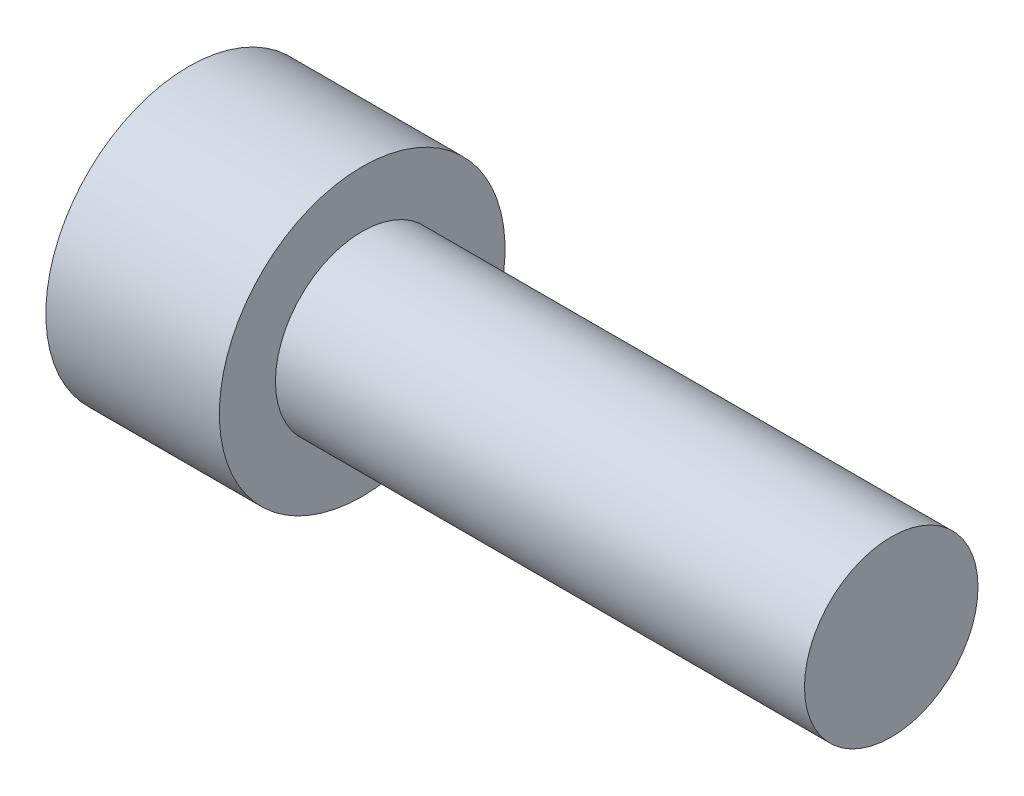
ISO-10303-21;
HEADER;
FILE_DESCRIPTION(('STEP AP214'),'2;1');
FILE_NAME('part.step','',(''),(''),'','','');
FILE_SCHEMA(('AUTOMOTIVE_DESIGN { 1 0 10303 214 1 1 1 1 }'));
ENDSEC;
DATA;
#1=APPLICATION_CONTEXT('core data for automotive mechanical design processes');
#2=APPLICATION_PROTOCOL_DEFINITION('international standard','automotive_design',2000,#1);
#3=PRODUCT_CONTEXT('',#1,'mechanical');
#4=PRODUCT('Part','Part','',(#3));
#5=PRODUCT_RELATED_PRODUCT_CATEGORY('part','',(#4));
#6=PRODUCT_DEFINITION_FORMATION('','',#4);
#7=PRODUCT_DEFINITION_CONTEXT('part definition',#1,'design');
#8=PRODUCT_DEFINITION('design','',#6,#7);
#9=PRODUCT_DEFINITION_SHAPE('','',#8);
#10=(LENGTH_UNIT() NAMED_UNIT(*) SI_UNIT(.MILLI.,.METRE.));
#11=(NAMED_UNIT(*) PLANE_ANGLE_UNIT() SI_UNIT($,.RADIAN.));
#12=(NAMED_UNIT(*) SI_UNIT($,.STERADIAN.) SOLID_ANGLE_UNIT());
#13=UNCERTAINTY_MEASURE_WITH_UNIT(LENGTH_MEASURE(1.E-05),#10,'distance_accuracy_value','');
#14=(GEOMETRIC_REPRESENTATION_CONTEXT(3) GLOBAL_UNCERTAINTY_ASSIGNED_CONTEXT((#13)) GLOBAL_UNIT_ASSIGNED_CONTEXT((#10,
#11,#12)) REPRESENTATION_CONTEXT('',''));
#15=CARTESIAN_POINT('',(0.,0.,0.));
#16=DIRECTION('',(0.,0.,1.));
#17=DIRECTION('',(1.,0.,0.));
#18=AXIS2_PLACEMENT_3D('',#15,#16,#17);
#19=CARTESIAN_POINT('',(16.8656,0.,0.));
#20=DIRECTION('',(1.,0.,0.));
#21=DIRECTION('',(0.,1.,0.));
#22=AXIS2_PLACEMENT_3D('',#19,#20,#21);
#23=PLANE('',#22);
#24=CARTESIAN_POINT('',(16.8656,0.,0.));
#25=DIRECTION('',(1.,0.,0.));
#26=DIRECTION('',(0.,1.,0.));
#27=AXIS2_PLACEMENT_3D('',#24,#25,#26);
#28=CIRCLE('',#27,2.0828);
#29=CARTESIAN_POINT('',(16.8656,2.0828,0.));
#30=VERTEX_POINT('',#29);
#31=EDGE_CURVE('E11',#30,#30,#28,.T.);
#32=ORIENTED_EDGE('',*,*,#31,.T.);
#33=EDGE_LOOP('',(#32));
#34=FACE_BOUND('',#33,.T.);
#35=ADVANCED_FACE('F380',(#34),#23,.T.);
#36=CARTESIAN_POINT('',(16.8656,0.,0.));
#37=DIRECTION('',(1.,0.,0.));
#38=DIRECTION('',(0.,1.,0.));
#39=AXIS2_PLACEMENT_3D('',#36,#37,#38);
#40=CYLINDRICAL_SURFACE('',#39,2.0828);
#41=CARTESIAN_POINT('',(4.1656,0.,0.));
#42=DIRECTION('',(1.,0.,0.));
#43=DIRECTION('',(0.,1.,0.));
#44=AXIS2_PLACEMENT_3D('',#41,#42,#43);
#45=CIRCLE('',#44,2.0828);
#46=CARTESIAN_POINT('',(4.1656,2.0828,0.));
#47=VERTEX_POINT('',#46);
#48=EDGE_CURVE('E387',#47,#47,#45,.T.);
#49=ORIENTED_EDGE('',*,*,#48,.T.);
#50=EDGE_LOOP('',(#49));
#51=FACE_BOUND('',#50,.T.);
#52=ORIENTED_EDGE('',*,*,#31,.F.);
#53=EDGE_LOOP('',(#52));
#54=FACE_BOUND('',#53,.T.);
#55=ADVANCED_FACE('F496',(#51,#54),#40,.T.);
#56=CARTESIAN_POINT('',(4.1656,3.429,0.));
#57=DIRECTION('',(1.,0.,0.));
#58=DIRECTION('',(0.,1.,0.));
#59=AXIS2_PLACEMENT_3D('',#56,#57,#58);
#60=PLANE('',#59);
#61=CARTESIAN_POINT('',(4.1656,0.,0.));
#62=DIRECTION('',(1.,0.,0.));
#63=DIRECTION('',(0.,1.,0.));
#64=AXIS2_PLACEMENT_3D('',#61,#62,#63);
#65=CIRCLE('',#64,3.429);
#66=CARTESIAN_POINT('',(4.1656,3.429,0.));
#67=VERTEX_POINT('',#66);
#68=EDGE_CURVE('E491',#67,#67,#65,.T.);
#69=ORIENTED_EDGE('',*,*,#68,.T.);
#70=EDGE_LOOP('',(#69));
#71=FACE_BOUND('',#70,.T.);
#72=ORIENTED_EDGE('',*,*,#48,.F.);
#73=EDGE_LOOP('',(#72));
#74=FACE_BOUND('',#73,.T.);
#75=ADVANCED_FACE('F499',(#71,#74),#60,.T.);
#76=CARTESIAN_POINT('',(16.8656,0.,0.));
#77=DIRECTION('',(1.,0.,0.));
#78=DIRECTION('',(0.,1.,0.));
#79=AXIS2_PLACEMENT_3D('',#76,#77,#78);
#80=CYLINDRICAL_SURFACE('',#79,3.429);
#81=CARTESIAN_POINT('',(0.,0.,0.));
#82=DIRECTION('',(1.,0.,0.));
#83=DIRECTION('',(0.,1.,0.));
#84=AXIS2_PLACEMENT_3D('',#81,#82,#83);
#85=CIRCLE('',#84,3.429);
#86=CARTESIAN_POINT('',(0.,3.429,0.));
#87=VERTEX_POINT('',#86);
#88=EDGE_CURVE('E482',#87,#87,#85,.T.);
#89=ORIENTED_EDGE('',*,*,#88,.T.);
#90=EDGE_LOOP('',(#89));
#91=FACE_BOUND('',#90,.T.);
#92=ORIENTED_EDGE('',*,*,#68,.F.);
#93=EDGE_LOOP('',(#92));
#94=FACE_BOUND('',#93,.T.);
#95=ADVANCED_FACE('F501',(#91,#94),#80,.T.);
#96=CARTESIAN_POINT('',(0.,0.,0.));
#97=DIRECTION('',(-1.,0.,0.));
#98=DIRECTION('',(0.,-1.,0.));
#99=AXIS2_PLACEMENT_3D('',#96,#97,#98);
#100=PLANE('',#99);
#101=DIRECTION('',(0.,0.866025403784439,0.5));
#102=VECTOR('',#101,1.);
#103=CARTESIAN_POINT('',(0.,-1.7859375,1.03111149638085));
#104=LINE('',#103,#102);
#105=CARTESIAN_POINT('',(0.,-1.7859375,1.03111149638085));
#106=VERTEX_POINT('',#105);
#107=CARTESIAN_POINT('',(0.,0.,2.06222299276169));
#108=VERTEX_POINT('',#107);
#109=EDGE_CURVE('E394',#106,#108,#104,.T.);
#110=ORIENTED_EDGE('',*,*,#109,.F.);
#111=DIRECTION('',(0.,0.,1.));
#112=VECTOR('',#111,1.);
#113=CARTESIAN_POINT('',(0.,-1.7859375,-1.03111149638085));
#114=LINE('',#113,#112);
#115=CARTESIAN_POINT('',(0.,-1.7859375,-1.03111149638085));
#116=VERTEX_POINT('',#115);
#117=EDGE_CURVE('E464',#116,#106,#114,.T.);
#118=ORIENTED_EDGE('',*,*,#117,.F.);
#119=DIRECTION('',(0.,-0.866025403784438,0.5));
#120=VECTOR('',#119,1.);
#121=CARTESIAN_POINT('',(0.,0.,-2.06222299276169));
#122=LINE('',#121,#120);
#123=CARTESIAN_POINT('',(0.,0.,-2.06222299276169));
#124=VERTEX_POINT('',#123);
#125=EDGE_CURVE('E458',#124,#116,#122,.T.);
#126=ORIENTED_EDGE('',*,*,#125,.F.);
#127=DIRECTION('',(0.,-0.866025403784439,-0.499999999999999));
#128=VECTOR('',#127,1.);
#129=CARTESIAN_POINT('',(0.,1.7859375,-1.03111149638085));
#130=LINE('',#129,#128);
#131=CARTESIAN_POINT('',(0.,1.7859375,-1.03111149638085));
#132=VERTEX_POINT('',#131);
#133=EDGE_CURVE('E456',#132,#124,#130,.T.);
#134=ORIENTED_EDGE('',*,*,#133,.F.);
#135=DIRECTION('',(0.,0.,-1.));
#136=VECTOR('',#135,1.);
#137=CARTESIAN_POINT('',(0.,1.7859375,1.03111149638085));
#138=LINE('',#137,#136);
#139=CARTESIAN_POINT('',(0.,1.7859375,1.03111149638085));
#140=VERTEX_POINT('',#139);
#141=EDGE_CURVE('E437',#140,#132,#138,.T.);
#142=ORIENTED_EDGE('',*,*,#141,.F.);
#143=DIRECTION('',(0.,0.866025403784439,-0.5));
#144=VECTOR('',#143,1.);
#145=CARTESIAN_POINT('',(0.,0.,2.06222299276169));
#146=LINE('',#145,#144);
#147=EDGE_CURVE('E448',#108,#140,#146,.T.);
#148=ORIENTED_EDGE('',*,*,#147,.F.);
#149=EDGE_LOOP('',(#110,#118,#126,#134,#142,#148));
#150=FACE_BOUND('',#149,.T.);
#151=ORIENTED_EDGE('',*,*,#88,.F.);
#152=EDGE_LOOP('',(#151));
#153=FACE_BOUND('',#152,.T.);
#154=ADVANCED_FACE('F452',(#150,#153),#100,.T.);
#155=CARTESIAN_POINT('',(2.794,-1.7859375,1.03111149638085));
#156=DIRECTION('',(0.,-0.5,0.866025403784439));
#157=DIRECTION('',(0.,-0.866025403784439,-0.5));
#158=AXIS2_PLACEMENT_3D('',#155,#156,#157);
#159=PLANE('',#158);
#160=ORIENTED_EDGE('',*,*,#109,.T.);
#161=DIRECTION('',(-1.,0.,0.));
#162=VECTOR('',#161,1.);
#163=CARTESIAN_POINT('',(2.794,0.,2.06222299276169));
#164=LINE('',#163,#162);
#165=CARTESIAN_POINT('',(2.794,0.,2.06222299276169));
#166=VERTEX_POINT('',#165);
#167=EDGE_CURVE('E445',#166,#108,#164,.T.);
#168=ORIENTED_EDGE('',*,*,#167,.F.);
#169=DIRECTION('',(0.,0.866025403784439,0.5));
#170=VECTOR('',#169,1.);
#171=CARTESIAN_POINT('',(2.794,-1.7859375,1.03111149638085));
#172=LINE('',#171,#170);
#173=CARTESIAN_POINT('',(2.794,-1.7859375,1.03111149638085));
#174=VERTEX_POINT('',#173);
#175=EDGE_CURVE('E466',#174,#166,#172,.T.);
#176=ORIENTED_EDGE('',*,*,#175,.F.);
#177=DIRECTION('',(-1.,0.,0.));
#178=VECTOR('',#177,1.);
#179=CARTESIAN_POINT('',(2.794,-1.7859375,1.03111149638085));
#180=LINE('',#179,#178);
#181=EDGE_CURVE('E401',#174,#106,#180,.T.);
#182=ORIENTED_EDGE('',*,*,#181,.T.);
#183=EDGE_LOOP('',(#160,#168,#176,#182));
#184=FACE_BOUND('',#183,.T.);
#185=ADVANCED_FACE('F532',(#184),#159,.F.);
#186=CARTESIAN_POINT('',(2.794,-1.7859375,-1.03111149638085));
#187=DIRECTION('',(0.,-1.,0.));
#188=DIRECTION('',(1.,0.,0.));
#189=AXIS2_PLACEMENT_3D('',#186,#187,#188);
#190=PLANE('',#189);
#191=ORIENTED_EDGE('',*,*,#117,.T.);
#192=ORIENTED_EDGE('',*,*,#181,.F.);
#193=DIRECTION('',(0.,0.,1.));
#194=VECTOR('',#193,1.);
#195=CARTESIAN_POINT('',(2.794,-1.7859375,-1.03111149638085));
#196=LINE('',#195,#194);
#197=CARTESIAN_POINT('',(2.794,-1.7859375,-1.03111149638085));
#198=VERTEX_POINT('',#197);
#199=EDGE_CURVE('E478',#198,#174,#196,.T.);
#200=ORIENTED_EDGE('',*,*,#199,.F.);
#201=DIRECTION('',(-1.,0.,0.));
#202=VECTOR('',#201,1.);
#203=CARTESIAN_POINT('',(2.794,-1.7859375,-1.03111149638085));
#204=LINE('',#203,#202);
#205=EDGE_CURVE('E483',#198,#116,#204,.T.);
#206=ORIENTED_EDGE('',*,*,#205,.T.);
#207=EDGE_LOOP('',(#191,#192,#200,#206));
#208=FACE_BOUND('',#207,.T.);
#209=ADVANCED_FACE('F539',(#208),#190,.F.);
#210=CARTESIAN_POINT('',(2.794,0.,-2.06222299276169));
#211=DIRECTION('',(0.,-0.5,-0.866025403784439));
#212=DIRECTION('',(0.,0.866025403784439,-0.5));
#213=AXIS2_PLACEMENT_3D('',#210,#211,#212);
#214=PLANE('',#213);
#215=ORIENTED_EDGE('',*,*,#125,.T.);
#216=ORIENTED_EDGE('',*,*,#205,.F.);
#217=DIRECTION('',(0.,-0.866025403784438,0.5));
#218=VECTOR('',#217,1.);
#219=CARTESIAN_POINT('',(2.794,0.,-2.06222299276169));
#220=LINE('',#219,#218);
#221=CARTESIAN_POINT('',(2.794,0.,-2.06222299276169));
#222=VERTEX_POINT('',#221);
#223=EDGE_CURVE('E475',#222,#198,#220,.T.);
#224=ORIENTED_EDGE('',*,*,#223,.F.);
#225=DIRECTION('',(-1.,0.,0.));
#226=VECTOR('',#225,1.);
#227=CARTESIAN_POINT('',(2.794,0.,-2.06222299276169));
#228=LINE('',#227,#226);
#229=EDGE_CURVE('E485',#222,#124,#228,.T.);
#230=ORIENTED_EDGE('',*,*,#229,.T.);
#231=EDGE_LOOP('',(#215,#216,#224,#230));
#232=FACE_BOUND('',#231,.T.);
#233=ADVANCED_FACE('F546',(#232),#214,.F.);
#234=CARTESIAN_POINT('',(2.794,1.7859375,-1.03111149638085));
#235=DIRECTION('',(0.,0.5,-0.866025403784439));
#236=DIRECTION('',(0.,0.866025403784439,0.5));
#237=AXIS2_PLACEMENT_3D('',#234,#235,#236);
#238=PLANE('',#237);
#239=ORIENTED_EDGE('',*,*,#133,.T.);
#240=ORIENTED_EDGE('',*,*,#229,.F.);
#241=DIRECTION('',(0.,-0.866025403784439,-0.499999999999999));
#242=VECTOR('',#241,1.);
#243=CARTESIAN_POINT('',(2.794,1.7859375,-1.03111149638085));
#244=LINE('',#243,#242);
#245=CARTESIAN_POINT('',(2.794,1.7859375,-1.03111149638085));
#246=VERTEX_POINT('',#245);
#247=EDGE_CURVE('E472',#246,#222,#244,.T.);
#248=ORIENTED_EDGE('',*,*,#247,.F.);
#249=DIRECTION('',(-1.,0.,0.));
#250=VECTOR('',#249,1.);
#251=CARTESIAN_POINT('',(2.794,1.7859375,-1.03111149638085));
#252=LINE('',#251,#250);
#253=EDGE_CURVE('E444',#246,#132,#252,.T.);
#254=ORIENTED_EDGE('',*,*,#253,.T.);
#255=EDGE_LOOP('',(#239,#240,#248,#254));
#256=FACE_BOUND('',#255,.T.);
#257=ADVANCED_FACE('F553',(#256),#238,.F.);
#258=CARTESIAN_POINT('',(2.794,1.7859375,1.03111149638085));
#259=DIRECTION('',(0.,1.,0.));
#260=DIRECTION('',(-1.,0.,0.));
#261=AXIS2_PLACEMENT_3D('',#258,#259,#260);
#262=PLANE('',#261);
#263=ORIENTED_EDGE('',*,*,#141,.T.);
#264=ORIENTED_EDGE('',*,*,#253,.F.);
#265=DIRECTION('',(0.,0.,-1.));
#266=VECTOR('',#265,1.);
#267=CARTESIAN_POINT('',(2.794,1.7859375,1.03111149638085));
#268=LINE('',#267,#266);
#269=CARTESIAN_POINT('',(2.794,1.7859375,1.03111149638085));
#270=VERTEX_POINT('',#269);
#271=EDGE_CURVE('E440',#270,#246,#268,.T.);
#272=ORIENTED_EDGE('',*,*,#271,.F.);
#273=DIRECTION('',(-1.,0.,0.));
#274=VECTOR('',#273,1.);
#275=CARTESIAN_POINT('',(2.794,1.7859375,1.03111149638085));
#276=LINE('',#275,#274);
#277=EDGE_CURVE('E433',#270,#140,#276,.T.);
#278=ORIENTED_EDGE('',*,*,#277,.T.);
#279=EDGE_LOOP('',(#263,#264,#272,#278));
#280=FACE_BOUND('',#279,.T.);
#281=ADVANCED_FACE('F435',(#280),#262,.F.);
#282=CARTESIAN_POINT('',(2.794,0.,2.06222299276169));
#283=DIRECTION('',(0.,0.5,0.866025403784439));
#284=DIRECTION('',(0.,-0.866025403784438,0.5));
#285=AXIS2_PLACEMENT_3D('',#282,#283,#284);
#286=PLANE('',#285);
#287=ORIENTED_EDGE('',*,*,#147,.T.);
#288=ORIENTED_EDGE('',*,*,#277,.F.);
#289=DIRECTION('',(0.,0.866025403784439,-0.5));
#290=VECTOR('',#289,1.);
#291=CARTESIAN_POINT('',(2.794,0.,2.06222299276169));
#292=LINE('',#291,#290);
#293=EDGE_CURVE('E469',#166,#270,#292,.T.);
#294=ORIENTED_EDGE('',*,*,#293,.F.);
#295=ORIENTED_EDGE('',*,*,#167,.T.);
#296=EDGE_LOOP('',(#287,#288,#294,#295));
#297=FACE_BOUND('',#296,.T.);
#298=ADVANCED_FACE('F449',(#297),#286,.F.);
#299=CARTESIAN_POINT('',(2.794,1.7859375,3.09333448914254));
#300=DIRECTION('',(-1.,0.,0.));
#301=DIRECTION('',(0.,-1.,0.));
#302=AXIS2_PLACEMENT_3D('',#299,#300,#301);
#303=PLANE('',#302);
#304=ORIENTED_EDGE('',*,*,#175,.T.);
#305=ORIENTED_EDGE('',*,*,#293,.T.);
#306=ORIENTED_EDGE('',*,*,#271,.T.);
#307=ORIENTED_EDGE('',*,*,#247,.T.);
#308=ORIENTED_EDGE('',*,*,#223,.T.);
#309=ORIENTED_EDGE('',*,*,#199,.T.);
#310=EDGE_LOOP('',(#304,#305,#306,#307,#308,#309));
#311=FACE_BOUND('',#310,.T.);
#312=ADVANCED_FACE('F574',(#311),#303,.T.);
#313=CLOSED_SHELL('',(#35,#55,#75,#95,#154,#185,#209,#233,#257,#281,#298,#312));
#314=MANIFOLD_SOLID_BREP('B2',#313);
#315=ADVANCED_BREP_SHAPE_REPRESENTATION('',(#18,#314),#14);
#316=SHAPE_DEFINITION_REPRESENTATION(#9,#315);
ENDSEC;
END-ISO-10303-21;
